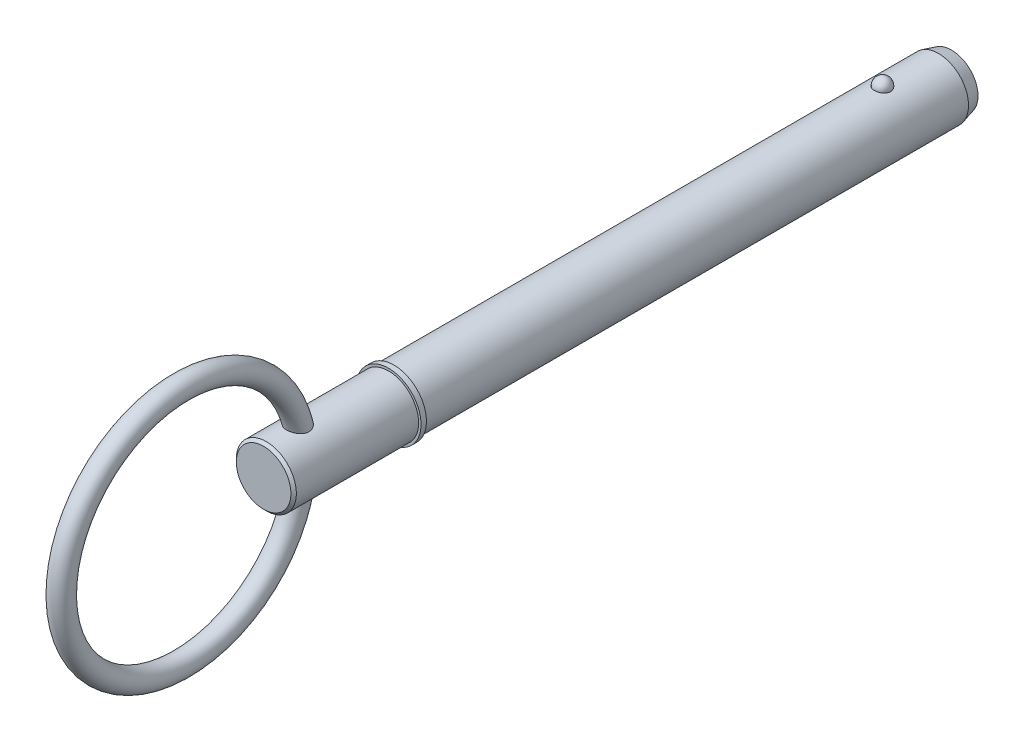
ISO-10303-21;
HEADER;
FILE_DESCRIPTION(('STEP AP214'),'2;1');
FILE_NAME('part.step','',(''),(''),'','','');
FILE_SCHEMA(('AUTOMOTIVE_DESIGN { 1 0 10303 214 1 1 1 1 }'));
ENDSEC;
DATA;
#1=APPLICATION_CONTEXT('core data for automotive mechanical design processes');
#2=APPLICATION_PROTOCOL_DEFINITION('international standard','automotive_design',2000,#1);
#3=PRODUCT_CONTEXT('',#1,'mechanical');
#4=PRODUCT('Part','Part','',(#3));
#5=PRODUCT_RELATED_PRODUCT_CATEGORY('part','',(#4));
#6=PRODUCT_DEFINITION_FORMATION('','',#4);
#7=PRODUCT_DEFINITION_CONTEXT('part definition',#1,'design');
#8=PRODUCT_DEFINITION('design','',#6,#7);
#9=PRODUCT_DEFINITION_SHAPE('','',#8);
#10=(LENGTH_UNIT() NAMED_UNIT(*) SI_UNIT(.MILLI.,.METRE.));
#11=(NAMED_UNIT(*) PLANE_ANGLE_UNIT() SI_UNIT($,.RADIAN.));
#12=(NAMED_UNIT(*) SI_UNIT($,.STERADIAN.) SOLID_ANGLE_UNIT());
#13=UNCERTAINTY_MEASURE_WITH_UNIT(LENGTH_MEASURE(1.E-05),#10,'distance_accuracy_value','');
#14=(GEOMETRIC_REPRESENTATION_CONTEXT(3) GLOBAL_UNCERTAINTY_ASSIGNED_CONTEXT((#13)) GLOBAL_UNIT_ASSIGNED_CONTEXT((#10,
#11,#12)) REPRESENTATION_CONTEXT('',''));
#15=CARTESIAN_POINT('',(0.,0.,0.));
#16=DIRECTION('',(0.,0.,1.));
#17=DIRECTION('',(1.,0.,0.));
#18=AXIS2_PLACEMENT_3D('',#15,#16,#17);
#19=CARTESIAN_POINT('',(0.,0.,88.9));
#20=DIRECTION('',(0.,0.,-1.));
#21=DIRECTION('',(-1.,0.,0.));
#22=AXIS2_PLACEMENT_3D('',#19,#20,#21);
#23=CYLINDRICAL_SURFACE('',#22,5.555);
#24=CARTESIAN_POINT('',(1.47653932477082,5.35517101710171,-1.49));
#25=CARTESIAN_POINT('',(1.4765376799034,5.35517235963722,-1.40667872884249));
#26=CARTESIAN_POINT('',(1.4697233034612,5.35706459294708,-1.32333626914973));
#27=CARTESIAN_POINT('',(1.4426291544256,5.36442332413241,-1.15900769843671));
#28=CARTESIAN_POINT('',(1.42234344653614,5.36989139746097,-1.07802264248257));
#29=CARTESIAN_POINT('',(1.36882802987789,5.38378061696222,-0.920757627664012));
#30=CARTESIAN_POINT('',(1.33560404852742,5.39220045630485,-0.844475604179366));
#31=CARTESIAN_POINT('',(1.25704906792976,5.41105136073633,-0.698703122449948));
#32=CARTESIAN_POINT('',(1.21171855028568,5.42148234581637,-0.629212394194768));
#33=CARTESIAN_POINT('',(1.10986325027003,5.44324765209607,-0.498626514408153));
#34=CARTESIAN_POINT('',(1.05328868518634,5.45458585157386,-0.437570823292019));
#35=CARTESIAN_POINT('',(0.930545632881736,5.4768596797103,-0.325918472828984));
#36=CARTESIAN_POINT('',(0.864377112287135,5.48779530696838,-0.275321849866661));
#37=CARTESIAN_POINT('',(0.724412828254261,5.50801510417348,-0.186125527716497));
#38=CARTESIAN_POINT('',(0.650637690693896,5.51730356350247,-0.147494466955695));
#39=CARTESIAN_POINT('',(0.497383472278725,5.53322345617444,-0.0831582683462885));
#40=CARTESIAN_POINT('',(0.417904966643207,5.53985515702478,-0.0574518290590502));
#41=CARTESIAN_POINT('',(0.256903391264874,5.54963245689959,-0.0200294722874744));
#42=CARTESIAN_POINT('',(0.17543580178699,5.55283384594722,-0.00808940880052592));
#43=CARTESIAN_POINT('',(0.011588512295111,5.55559187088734,0.00221439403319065));
#44=CARTESIAN_POINT('',(-0.0707911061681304,5.55514883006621,0.000579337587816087));
#45=CARTESIAN_POINT('',(-0.232980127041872,5.55069756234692,-0.0161051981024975));
#46=CARTESIAN_POINT('',(-0.312809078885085,5.54673626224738,-0.0309781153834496));
#47=CARTESIAN_POINT('',(-0.468771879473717,5.5357377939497,-0.0734743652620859));
#48=CARTESIAN_POINT('',(-0.544905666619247,5.52870057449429,-0.101097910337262));
#49=CARTESIAN_POINT('',(-0.691800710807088,5.51225307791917,-0.168516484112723));
#50=CARTESIAN_POINT('',(-0.762530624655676,5.50283015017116,-0.2083766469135));
#51=CARTESIAN_POINT('',(-0.896294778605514,5.48263289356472,-0.299136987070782));
#52=CARTESIAN_POINT('',(-0.959328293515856,5.47185843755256,-0.350038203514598));
#53=CARTESIAN_POINT('',(-1.07712789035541,5.44990641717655,-0.462517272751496));
#54=CARTESIAN_POINT('',(-1.13172901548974,5.43872509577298,-0.524267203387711));
#55=CARTESIAN_POINT('',(-1.2299173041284,5.41736658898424,-0.656133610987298));
#56=CARTESIAN_POINT('',(-1.2735037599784,5.40718946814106,-0.726250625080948));
#57=CARTESIAN_POINT('',(-1.34896420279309,5.38886361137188,-0.873713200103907));
#58=CARTESIAN_POINT('',(-1.38071142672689,5.38073711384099,-0.951126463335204));
#59=CARTESIAN_POINT('',(-1.4310375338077,5.36757288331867,-1.11037033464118));
#60=CARTESIAN_POINT('',(-1.44961676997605,5.3625350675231,-1.19220082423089));
#61=CARTESIAN_POINT('',(-1.47308754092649,5.35613553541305,-1.35761209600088));
#62=CARTESIAN_POINT('',(-1.47803294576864,5.35475935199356,-1.44118467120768));
#63=CARTESIAN_POINT('',(-1.47426441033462,5.35579807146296,-1.6079958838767));
#64=CARTESIAN_POINT('',(-1.46555080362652,5.35821288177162,-1.69123452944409));
#65=CARTESIAN_POINT('',(-1.43475662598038,5.36653964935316,-1.8546288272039));
#66=CARTESIAN_POINT('',(-1.41273621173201,5.37243586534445,-1.93479663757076));
#67=CARTESIAN_POINT('',(-1.35593151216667,5.38705199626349,-2.09020110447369));
#68=CARTESIAN_POINT('',(-1.32114675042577,5.39577201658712,-2.16543757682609));
#69=CARTESIAN_POINT('',(-1.23947506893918,5.41511674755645,-2.30926926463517));
#70=CARTESIAN_POINT('',(-1.1925277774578,5.42575087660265,-2.37782893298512));
#71=CARTESIAN_POINT('',(-1.08780725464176,5.44771095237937,-2.50598876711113));
#72=CARTESIAN_POINT('',(-1.03003365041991,5.4590369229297,-2.56558862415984));
#73=CARTESIAN_POINT('',(-0.90495349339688,5.48116073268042,-2.67436535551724));
#74=CARTESIAN_POINT('',(-0.837616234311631,5.49195671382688,-2.7235073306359));
#75=CARTESIAN_POINT('',(-0.69537970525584,5.51177099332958,-2.8097317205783));
#76=CARTESIAN_POINT('',(-0.620480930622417,5.52078940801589,-2.84681492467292));
#77=CARTESIAN_POINT('',(-0.466144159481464,5.53594369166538,-2.90749751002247));
#78=CARTESIAN_POINT('',(-0.386768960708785,5.54211181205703,-2.93124844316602));
#79=CARTESIAN_POINT('',(-0.224991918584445,5.5510324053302,-2.96523308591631));
#80=CARTESIAN_POINT('',(-0.142590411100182,5.55378525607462,-2.97546829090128));
#81=CARTESIAN_POINT('',(0.0213711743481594,5.55555351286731,-2.98206550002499));
#82=CARTESIAN_POINT('',(0.102921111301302,5.55463281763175,-2.97866468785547));
#83=CARTESIAN_POINT('',(0.2642564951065,5.54929804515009,-2.95862186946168));
#84=CARTESIAN_POINT('',(0.344041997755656,5.54488407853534,-2.94198028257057));
#85=CARTESIAN_POINT('',(0.499344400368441,5.53305794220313,-2.89600357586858));
#86=CARTESIAN_POINT('',(0.574874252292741,5.52565550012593,-2.86670961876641));
#87=CARTESIAN_POINT('',(0.71989857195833,5.50863937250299,-2.79624249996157));
#88=CARTESIAN_POINT('',(0.78939269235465,5.49902555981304,-2.75506865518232));
#89=CARTESIAN_POINT('',(0.921480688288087,5.47845199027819,-2.66127110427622));
#90=CARTESIAN_POINT('',(0.983960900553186,5.46747485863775,-2.60849118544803));
#91=CARTESIAN_POINT('',(1.09925057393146,5.44546837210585,-2.49325304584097));
#92=CARTESIAN_POINT('',(1.15205830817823,5.43443900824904,-2.43079310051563));
#93=CARTESIAN_POINT('',(1.24742943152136,5.41335152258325,-2.29680711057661));
#94=CARTESIAN_POINT('',(1.28981661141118,5.40331162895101,-2.22515272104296));
#95=CARTESIAN_POINT('',(1.36214937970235,5.38553336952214,-2.07558035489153));
#96=CARTESIAN_POINT('',(1.39210034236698,5.37779400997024,-1.99766510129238));
#97=CARTESIAN_POINT('',(1.43569518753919,5.36630594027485,-1.84848338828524));
#98=CARTESIAN_POINT('',(1.45098536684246,5.36216169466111,-1.77772322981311));
#99=CARTESIAN_POINT('',(1.47140805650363,5.35659367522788,-1.63464735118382));
#100=CARTESIAN_POINT('',(1.47654075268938,5.35516985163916,-1.5623316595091));
#101=CARTESIAN_POINT('',(1.47653932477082,5.35517101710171,-1.49));
#102=B_SPLINE_CURVE_WITH_KNOTS('',3,(#24,#25,#26,#27,#28,#29,#30,#31,#32,#33,#34,#35,#36,#37,
#38,#39,#40,#41,#42,#43,#44,#45,#46,#47,#48,#49,#50,#51,#52,#53,#54,#55,#56,#57,#58,#59,#60,#61,
#62,#63,#64,#65,#66,#67,#68,#69,#70,#71,#72,#73,#74,#75,#76,#77,#78,#79,#80,#81,#82,#83,#84,#85,
#86,#87,#88,#89,#90,#91,#92,#93,#94,#95,#96,#97,#98,#99,#100,#101),.UNSPECIFIED.,.T.,.F.,(4,2,2,
2,2,2,2,2,2,2,2,2,2,2,2,2,2,2,2,2,2,2,2,2,2,2,2,2,2,2,2,2,2,2,2,2,2,2,4),(0.,0.249703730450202,
0.4995175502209,0.749220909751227,0.998914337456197,1.24973894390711,1.50056442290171,
1.75072681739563,2.00086401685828,2.24686822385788,2.49285060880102,2.73560052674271,
2.97835449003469,3.22242369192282,3.46651587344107,3.71490232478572,3.96330473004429,
4.21429522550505,4.46527899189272,4.71526963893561,4.96525418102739,5.21411697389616,
5.46298905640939,5.71312097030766,5.96326150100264,6.21422412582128,6.46517032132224,
6.71320296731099,6.96120816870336,7.20491846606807,7.44862104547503,7.69153667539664,
7.93446627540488,8.18089104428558,8.42735976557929,8.67774679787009,8.92802551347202,
9.14479867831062,9.36156787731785),.UNSPECIFIED.);
#103=CARTESIAN_POINT('',(1.47653932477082,5.35517101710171,-1.49));
#104=VERTEX_POINT('',#103);
#105=EDGE_CURVE('E102',#104,#104,#102,.T.);
#106=ORIENTED_EDGE('',*,*,#105,.T.);
#107=EDGE_LOOP('',(#106));
#108=FACE_BOUND('',#107,.T.);
#109=CARTESIAN_POINT('',(0.,0.,-11.87));
#110=DIRECTION('',(0.,0.,-1.));
#111=DIRECTION('',(-1.,0.,0.));
#112=AXIS2_PLACEMENT_3D('',#109,#110,#111);
#113=CIRCLE('',#112,5.555);
#114=CARTESIAN_POINT('',(-5.555,0.,-11.87));
#115=VERTEX_POINT('',#114);
#116=EDGE_CURVE('E110',#115,#115,#113,.F.);
#117=ORIENTED_EDGE('',*,*,#116,.T.);
#118=EDGE_LOOP('',(#117));
#119=FACE_BOUND('',#118,.T.);
#120=CARTESIAN_POINT('',(0.,0.,88.9));
#121=DIRECTION('',(0.,0.,1.));
#122=DIRECTION('',(1.,0.,0.));
#123=AXIS2_PLACEMENT_3D('',#120,#121,#122);
#124=CIRCLE('',#123,5.555);
#125=CARTESIAN_POINT('',(5.555,0.,88.9));
#126=VERTEX_POINT('',#125);
#127=EDGE_CURVE('E108',#126,#126,#124,.T.);
#128=ORIENTED_EDGE('',*,*,#127,.F.);
#129=EDGE_LOOP('',(#128));
#130=FACE_BOUND('',#129,.T.);
#131=ADVANCED_FACE('F39',(#108,#119,#130),#23,.T.);
#132=CARTESIAN_POINT('',(0.,0.,-14.27));
#133=DIRECTION('',(0.,0.,-1.));
#134=DIRECTION('',(-1.,0.,0.));
#135=AXIS2_PLACEMENT_3D('',#132,#133,#134);
#136=PLANE('',#135);
#137=CARTESIAN_POINT('',(0.,0.,-14.27));
#138=DIRECTION('',(0.,0.,-1.));
#139=DIRECTION('',(-1.,0.,0.));
#140=AXIS2_PLACEMENT_3D('',#137,#138,#139);
#141=CIRCLE('',#140,4.91192193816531);
#142=CARTESIAN_POINT('',(-4.91192193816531,0.,-14.27));
#143=VERTEX_POINT('',#142);
#144=EDGE_CURVE('E142',#143,#143,#141,.T.);
#145=ORIENTED_EDGE('',*,*,#144,.T.);
#146=EDGE_LOOP('',(#145));
#147=FACE_BOUND('',#146,.T.);
#148=ADVANCED_FACE('F88',(#147),#136,.T.);
#149=CARTESIAN_POINT('',(0.,0.,-14.27));
#150=DIRECTION('',(0.,0.,1.));
#151=DIRECTION('',(1.,0.,0.));
#152=AXIS2_PLACEMENT_3D('',#149,#150,#151);
#153=CONICAL_SURFACE('',#152,4.91192193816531,0.261799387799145);
#154=ORIENTED_EDGE('',*,*,#116,.F.);
#155=EDGE_LOOP('',(#154));
#156=FACE_BOUND('',#155,.T.);
#157=ORIENTED_EDGE('',*,*,#144,.F.);
#158=EDGE_LOOP('',(#157));
#159=FACE_BOUND('',#158,.T.);
#160=ADVANCED_FACE('F94',(#156,#159),#153,.T.);
#161=CARTESIAN_POINT('',(0.,5.555,-1.49));
#162=DIRECTION('',(0.,1.,0.));
#163=DIRECTION('',(0.,0.,-1.));
#164=AXIS2_PLACEMENT_3D('',#161,#162,#163);
#165=SPHERICAL_SURFACE('',#164,1.49);
#166=ORIENTED_EDGE('',*,*,#105,.F.);
#167=EDGE_LOOP('',(#166));
#168=FACE_BOUND('',#167,.T.);
#169=ADVANCED_FACE('F113',(#168),#165,.T.);
#170=CARTESIAN_POINT('',(0.,0.,88.9));
#171=DIRECTION('',(0.,0.,-1.));
#172=DIRECTION('',(-1.,0.,0.));
#173=AXIS2_PLACEMENT_3D('',#170,#171,#172);
#174=PLANE('',#173);
#175=ORIENTED_EDGE('',*,*,#127,.T.);
#176=EDGE_LOOP('',(#175));
#177=FACE_BOUND('',#176,.T.);
#178=CARTESIAN_POINT('',(0.,0.,88.9));
#179=DIRECTION('',(0.,0.,-1.));
#180=DIRECTION('',(-1.,0.,0.));
#181=AXIS2_PLACEMENT_3D('',#178,#179,#180);
#182=CIRCLE('',#181,6.);
#183=CARTESIAN_POINT('',(-6.,0.,88.9));
#184=VERTEX_POINT('',#183);
#185=EDGE_CURVE('E109',#184,#184,#182,.T.);
#186=ORIENTED_EDGE('',*,*,#185,.T.);
#187=EDGE_LOOP('',(#186));
#188=FACE_BOUND('',#187,.T.);
#189=ADVANCED_FACE('F117',(#177,#188),#174,.T.);
#190=CARTESIAN_POINT('',(0.,0.,33.7287874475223));
#191=DIRECTION('',(0.,0.,-1.));
#192=DIRECTION('',(-1.,0.,0.));
#193=AXIS2_PLACEMENT_3D('',#190,#191,#192);
#194=CYLINDRICAL_SURFACE('',#193,6.);
#195=CARTESIAN_POINT('',(0.,0.,89.9));
#196=DIRECTION('',(0.,0.,-1.));
#197=DIRECTION('',(-1.,0.,0.));
#198=AXIS2_PLACEMENT_3D('',#195,#196,#197);
#199=CIRCLE('',#198,6.);
#200=CARTESIAN_POINT('',(-6.,0.,89.9));
#201=VERTEX_POINT('',#200);
#202=EDGE_CURVE('E134',#201,#201,#199,.T.);
#203=ORIENTED_EDGE('',*,*,#202,.T.);
#204=EDGE_LOOP('',(#203));
#205=FACE_BOUND('',#204,.T.);
#206=ORIENTED_EDGE('',*,*,#185,.F.);
#207=EDGE_LOOP('',(#206));
#208=FACE_BOUND('',#207,.T.);
#209=ADVANCED_FACE('F121',(#205,#208),#194,.T.);
#210=CARTESIAN_POINT('',(0.,6.,89.9));
#211=DIRECTION('',(0.,0.,1.));
#212=DIRECTION('',(1.,0.,0.));
#213=AXIS2_PLACEMENT_3D('',#210,#211,#212);
#214=PLANE('',#213);
#215=CARTESIAN_POINT('',(0.,0.,89.9));
#216=DIRECTION('',(0.,0.,1.));
#217=DIRECTION('',(1.,0.,0.));
#218=AXIS2_PLACEMENT_3D('',#215,#216,#217);
#219=CIRCLE('',#218,5.555);
#220=CARTESIAN_POINT('',(5.555,0.,89.9));
#221=VERTEX_POINT('',#220);
#222=EDGE_CURVE('E112',#221,#221,#219,.T.);
#223=ORIENTED_EDGE('',*,*,#222,.F.);
#224=EDGE_LOOP('',(#223));
#225=FACE_BOUND('',#224,.T.);
#226=ORIENTED_EDGE('',*,*,#202,.F.);
#227=EDGE_LOOP('',(#226));
#228=FACE_BOUND('',#227,.T.);
#229=ADVANCED_FACE('F85',(#225,#228),#214,.T.);
#230=CARTESIAN_POINT('',(0.,0.,113.03));
#231=DIRECTION('',(0.,0.,-1.));
#232=DIRECTION('',(-1.,0.,0.));
#233=AXIS2_PLACEMENT_3D('',#230,#231,#232);
#234=CYLINDRICAL_SURFACE('',#233,5.555);
#235=CARTESIAN_POINT('',(-0.961380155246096,-5.47117658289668,104.908733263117));
#236=CARTESIAN_POINT('',(-0.863231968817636,-5.48842171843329,104.857515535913));
#237=CARTESIAN_POINT('',(-0.7605484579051,-5.50372118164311,104.814318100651));
#238=CARTESIAN_POINT('',(-0.548956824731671,-5.52883500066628,104.744912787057));
#239=CARTESIAN_POINT('',(-0.440048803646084,-5.53864944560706,104.718704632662));
#240=CARTESIAN_POINT('',(-0.219033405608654,-5.55178384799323,104.683864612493));
#241=CARTESIAN_POINT('',(-0.106925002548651,-5.55510169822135,104.675238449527));
#242=CARTESIAN_POINT('',(0.11723899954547,-5.55489351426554,104.675783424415));
#243=CARTESIAN_POINT('',(0.229294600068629,-5.55136768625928,104.684954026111));
#244=CARTESIAN_POINT('',(0.449588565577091,-5.5378711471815,104.720784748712));
#245=CARTESIAN_POINT('',(0.557843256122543,-5.52793284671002,104.747356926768));
#246=CARTESIAN_POINT('',(0.768116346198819,-5.50265785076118,104.817309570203));
#247=CARTESIAN_POINT('',(0.87013418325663,-5.48732066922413,104.860691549));
#248=CARTESIAN_POINT('',(1.06580880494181,-5.45270790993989,104.963685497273));
#249=CARTESIAN_POINT('',(1.1594033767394,-5.43340601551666,105.023406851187));
#250=CARTESIAN_POINT('',(1.33484934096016,-5.39298781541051,105.157672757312));
#251=CARTESIAN_POINT('',(1.41670019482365,-5.37187142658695,105.232217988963));
#252=CARTESIAN_POINT('',(1.56628651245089,-5.33017932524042,105.394433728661));
#253=CARTESIAN_POINT('',(1.63402728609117,-5.30960341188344,105.482099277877));
#254=CARTESIAN_POINT('',(1.7533832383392,-5.27139606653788,105.66835593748));
#255=CARTESIAN_POINT('',(1.80500413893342,-5.25376359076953,105.766943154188));
#256=CARTESIAN_POINT('',(1.88923054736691,-5.22405733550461,105.968866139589));
#257=CARTESIAN_POINT('',(1.92240068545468,-5.21182119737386,106.071942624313));
#258=CARTESIAN_POINT('',(1.97156802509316,-5.19342304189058,106.282612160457));
#259=CARTESIAN_POINT('',(1.98756752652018,-5.18726021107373,106.390204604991));
#260=CARTESIAN_POINT('',(2.00238957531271,-5.1815556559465,106.604813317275));
#261=CARTESIAN_POINT('',(2.0015062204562,-5.18190056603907,106.711807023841));
#262=CARTESIAN_POINT('',(1.98404322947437,-5.18861029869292,106.924294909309));
#263=CARTESIAN_POINT('',(1.96745884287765,-5.19497694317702,107.02978862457));
#264=CARTESIAN_POINT('',(1.91810947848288,-5.21340722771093,107.243734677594));
#265=CARTESIAN_POINT('',(1.88435438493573,-5.22581720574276,107.351927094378));
#266=CARTESIAN_POINT('',(1.80161540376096,-5.25491400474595,107.561718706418));
#267=CARTESIAN_POINT('',(1.75262312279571,-5.27160318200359,107.663314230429));
#268=CARTESIAN_POINT('',(1.63431251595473,-5.30955034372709,107.868856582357));
#269=CARTESIAN_POINT('',(1.56333412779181,-5.33111051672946,107.971796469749));
#270=CARTESIAN_POINT('',(1.40529607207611,-5.37493145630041,108.16447165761));
#271=CARTESIAN_POINT('',(1.31822569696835,-5.39719268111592,108.254198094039));
#272=CARTESIAN_POINT('',(1.12728892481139,-5.44031451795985,108.419004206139));
#273=CARTESIAN_POINT('',(1.02309899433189,-5.46113424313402,108.493723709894));
#274=CARTESIAN_POINT('',(0.801576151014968,-5.49800171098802,108.621805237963));
#275=CARTESIAN_POINT('',(0.684264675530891,-5.51405708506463,108.675201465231));
#276=CARTESIAN_POINT('',(0.456877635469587,-5.53719478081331,108.750980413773));
#277=CARTESIAN_POINT('',(0.347974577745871,-5.54519800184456,108.776584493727));
#278=CARTESIAN_POINT('',(0.127042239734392,-5.55464249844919,108.806731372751));
#279=CARTESIAN_POINT('',(0.0150164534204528,-5.55609083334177,108.811296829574));
#280=CARTESIAN_POINT('',(-0.191993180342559,-5.55250986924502,108.799911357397));
#281=CARTESIAN_POINT('',(-0.287160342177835,-5.54836194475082,108.786752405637));
#282=CARTESIAN_POINT('',(-0.473863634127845,-5.53554271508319,108.745489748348));
#283=CARTESIAN_POINT('',(-0.565399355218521,-5.52687090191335,108.717384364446));
#284=CARTESIAN_POINT('',(-0.743786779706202,-5.50572322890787,108.647293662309));
#285=CARTESIAN_POINT('',(-0.830566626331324,-5.49320168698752,108.605141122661));
#286=CARTESIAN_POINT('',(-0.996720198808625,-5.46549909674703,108.508875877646));
#287=CARTESIAN_POINT('',(-1.07609119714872,-5.45031707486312,108.454758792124));
#288=CARTESIAN_POINT('',(-1.23672272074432,-5.41628785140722,108.328211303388));
#289=CARTESIAN_POINT('',(-1.31676039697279,-5.39722327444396,108.25428911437));
#290=CARTESIAN_POINT('',(-1.46504263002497,-5.3588760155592,108.095462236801));
#291=CARTESIAN_POINT('',(-1.53327828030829,-5.33959318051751,108.010549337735));
#292=CARTESIAN_POINT('',(-1.66602271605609,-5.29979878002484,107.818697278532));
#293=CARTESIAN_POINT('',(-1.72857256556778,-5.27951148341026,107.710347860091));
#294=CARTESIAN_POINT('',(-1.83559571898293,-5.24326402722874,107.484325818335));
#295=CARTESIAN_POINT('',(-1.88006296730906,-5.22730531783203,107.366650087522));
#296=CARTESIAN_POINT('',(-1.94988009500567,-5.20167534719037,107.122087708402));
#297=CARTESIAN_POINT('',(-1.97477410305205,-5.19215470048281,106.99505279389));
#298=CARTESIAN_POINT('',(-2.00168294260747,-5.18184594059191,106.738249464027));
#299=CARTESIAN_POINT('',(-2.0037221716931,-5.18104851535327,106.60848411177));
#300=CARTESIAN_POINT('',(-1.98467753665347,-5.18836681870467,106.364652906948));
#301=CARTESIAN_POINT('',(-1.96600067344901,-5.19555485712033,106.250370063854));
#302=CARTESIAN_POINT('',(-1.90923541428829,-5.21668050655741,106.027389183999));
#303=CARTESIAN_POINT('',(-1.87115335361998,-5.23061591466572,105.918689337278));
#304=CARTESIAN_POINT('',(-1.78015350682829,-5.26224244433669,105.718371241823));
#305=CARTESIAN_POINT('',(-1.72857344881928,-5.27957041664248,105.62608293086));
#306=CARTESIAN_POINT('',(-1.61106729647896,-5.31660340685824,105.451684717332));
#307=CARTESIAN_POINT('',(-1.54514024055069,-5.33630858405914,105.369575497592));
#308=CARTESIAN_POINT('',(-1.39929408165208,-5.37641320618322,105.215887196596));
#309=CARTESIAN_POINT('',(-1.31912544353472,-5.39681868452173,105.144546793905));
#310=CARTESIAN_POINT('',(-1.14786008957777,-5.43582099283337,105.015855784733));
#311=CARTESIAN_POINT('',(-1.05676174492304,-5.4544175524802,104.958507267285));
#312=CARTESIAN_POINT('',(-0.961380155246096,-5.47117658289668,104.908733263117));
#313=B_SPLINE_CURVE_WITH_KNOTS('',3,(#235,#236,#237,#238,#239,#240,#241,#242,#243,#244,#245,
#246,#247,#248,#249,#250,#251,#252,#253,#254,#255,#256,#257,#258,#259,#260,#261,#262,#263,#264,
#265,#266,#267,#268,#269,#270,#271,#272,#273,#274,#275,#276,#277,#278,#279,#280,#281,#282,#283,
#284,#285,#286,#287,#288,#289,#290,#291,#292,#293,#294,#295,#296,#297,#298,#299,#300,#301,#302,
#303,#304,#305,#306,#307,#308,#309,#310,#311,#312),.UNSPECIFIED.,.T.,.F.,(4,2,2,2,2,2,2,2,2,2,2,
2,2,2,2,2,2,2,2,2,2,2,2,2,2,2,2,2,2,2,2,2,2,2,2,2,2,2,4),(0.,0.335747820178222,0.67149018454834,
1.0073414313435,1.3431825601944,1.6773394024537,2.01152633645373,2.3480076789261,
2.68450444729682,3.02087435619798,3.35712472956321,3.68242216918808,4.0076760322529,
4.32726924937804,4.6469591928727,4.98762165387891,5.32847210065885,5.7074287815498,
6.08663853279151,6.47407889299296,6.86089527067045,7.19531213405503,7.52936875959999,
7.81649827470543,8.10366003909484,8.39437023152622,8.68518702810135,9.01572837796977,
9.34651809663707,9.72504519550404,10.1036989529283,10.4909301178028,10.8777478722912,
11.2239231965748,11.5699855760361,11.8899109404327,12.2098577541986,12.5360928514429,
12.8623766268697),.UNSPECIFIED.);
#314=CARTESIAN_POINT('',(-0.961380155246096,-5.47117658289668,104.908733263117));
#315=VERTEX_POINT('',#314);
#316=EDGE_CURVE('E10',#315,#315,#313,.T.);
#317=ORIENTED_EDGE('',*,*,#316,.F.);
#318=EDGE_LOOP('',(#317));
#319=FACE_BOUND('',#318,.T.);
#320=CARTESIAN_POINT('',(-0.961380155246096,5.47117658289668,104.908733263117));
#321=CARTESIAN_POINT('',(-1.05891474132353,5.45403910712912,104.959631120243));
#322=CARTESIAN_POINT('',(-1.15197270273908,5.43497920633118,105.018451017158));
#323=CARTESIAN_POINT('',(-1.32661268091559,5.39501222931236,105.15070162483));
#324=CARTESIAN_POINT('',(-1.40819495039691,5.37410519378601,105.224132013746));
#325=CARTESIAN_POINT('',(-1.55769110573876,5.33269731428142,105.384098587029));
#326=CARTESIAN_POINT('',(-1.62558729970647,5.3121970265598,105.470651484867));
#327=CARTESIAN_POINT('',(-1.74556031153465,5.27399510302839,105.654646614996));
#328=CARTESIAN_POINT('',(-1.7976419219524,5.25629262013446,105.752085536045));
#329=CARTESIAN_POINT('',(-1.88339939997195,5.22617061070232,105.952565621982));
#330=CARTESIAN_POINT('',(-1.91750373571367,5.21362983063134,106.055405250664));
#331=CARTESIAN_POINT('',(-1.96852412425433,5.194582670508,106.265778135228));
#332=CARTESIAN_POINT('',(-1.98544249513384,5.18807547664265,106.373310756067));
#333=CARTESIAN_POINT('',(-2.00201964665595,5.18170011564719,106.587819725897));
#334=CARTESIAN_POINT('',(-2.00199605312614,5.18170977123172,106.694768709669));
#335=CARTESIAN_POINT('',(-1.98621575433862,5.18777751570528,106.907306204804));
#336=CARTESIAN_POINT('',(-1.97045441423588,5.19383738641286,107.012894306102));
#337=CARTESIAN_POINT('',(-1.92280904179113,5.21167084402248,107.226914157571));
#338=CARTESIAN_POINT('',(-1.88996782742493,5.22378174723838,107.335103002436));
#339=CARTESIAN_POINT('',(-1.8090690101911,5.252344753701,107.545029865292));
#340=CARTESIAN_POINT('',(-1.76100319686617,5.26879919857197,107.646764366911));
#341=CARTESIAN_POINT('',(-1.64464870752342,5.30634509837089,107.852788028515));
#342=CARTESIAN_POINT('',(-1.57469702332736,5.32774959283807,107.956085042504));
#343=CARTESIAN_POINT('',(-1.41872356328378,5.37138743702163,108.149688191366));
#344=CARTESIAN_POINT('',(-1.3326906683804,5.39362135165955,108.239985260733));
#345=CARTESIAN_POINT('',(-1.14345202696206,5.43692909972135,108.406557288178));
#346=CARTESIAN_POINT('',(-1.03986000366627,5.45795811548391,108.482409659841));
#347=CARTESIAN_POINT('',(-0.819338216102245,5.49537389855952,108.612916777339));
#348=CARTESIAN_POINT('',(-0.70242947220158,5.51176784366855,108.667604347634));
#349=CARTESIAN_POINT('',(-0.475167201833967,5.53565843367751,108.74602203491));
#350=CARTESIAN_POINT('',(-0.365997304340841,5.54404610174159,108.772893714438));
#351=CARTESIAN_POINT('',(-0.144272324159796,5.55422966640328,108.805426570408));
#352=CARTESIAN_POINT('',(-0.031721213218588,5.55603301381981,108.811111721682));
#353=CARTESIAN_POINT('',(0.176166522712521,5.55303883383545,108.801592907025));
#354=CARTESIAN_POINT('',(0.271662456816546,5.54914868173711,108.789260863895));
#355=CARTESIAN_POINT('',(0.459140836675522,5.53678955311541,108.749523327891));
#356=CARTESIAN_POINT('',(0.551122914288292,5.52832009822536,108.722116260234));
#357=CARTESIAN_POINT('',(0.730082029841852,5.50755841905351,108.653437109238));
#358=CARTESIAN_POINT('',(0.817013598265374,5.49523641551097,108.612056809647));
#359=CARTESIAN_POINT('',(0.98356924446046,5.46788364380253,108.517293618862));
#360=CARTESIAN_POINT('',(1.06319070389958,5.45285191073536,108.463906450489));
#361=CARTESIAN_POINT('',(1.22430017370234,5.4191117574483,108.338982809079));
#362=CARTESIAN_POINT('',(1.30459540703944,5.40018081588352,108.265970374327));
#363=CARTESIAN_POINT('',(1.45353150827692,5.3620139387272,108.108943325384));
#364=CARTESIAN_POINT('',(1.52216366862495,5.3427777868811,108.024920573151));
#365=CARTESIAN_POINT('',(1.65601602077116,5.30294271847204,107.834811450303));
#366=CARTESIAN_POINT('',(1.71927851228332,5.28255425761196,107.727294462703));
#367=CARTESIAN_POINT('',(1.82790996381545,5.24595721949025,107.502847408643));
#368=CARTESIAN_POINT('',(1.8732722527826,5.22975020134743,107.385913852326));
#369=CARTESIAN_POINT('',(1.94526503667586,5.20341207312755,107.142194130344));
#370=CARTESIAN_POINT('',(1.97135787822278,5.1934564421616,107.01522738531));
#371=CARTESIAN_POINT('',(2.00068973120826,5.18223330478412,106.758318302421));
#372=CARTESIAN_POINT('',(2.00395290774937,5.18095661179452,106.628379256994));
#373=CARTESIAN_POINT('',(1.98717985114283,5.1874070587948,106.383763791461));
#374=CARTESIAN_POINT('',(1.96951989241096,5.19421607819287,106.268899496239));
#375=CARTESIAN_POINT('',(1.91463360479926,5.2146960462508,106.044589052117));
#376=CARTESIAN_POINT('',(1.87741409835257,5.22836460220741,105.935141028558));
#377=CARTESIAN_POINT('',(1.78800305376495,5.25957304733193,105.733542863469));
#378=CARTESIAN_POINT('',(1.73720600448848,5.27672774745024,105.640709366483));
#379=CARTESIAN_POINT('',(1.62116201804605,5.3135255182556,105.465121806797));
#380=CARTESIAN_POINT('',(1.55591428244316,5.33316872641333,105.382368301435));
#381=CARTESIAN_POINT('',(1.41164041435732,5.37317145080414,105.227648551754));
#382=CARTESIAN_POINT('',(1.33241957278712,5.39353732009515,105.155865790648));
#383=CARTESIAN_POINT('',(1.16300716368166,5.43258596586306,105.026112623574));
#384=CARTESIAN_POINT('',(1.07281393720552,5.45126848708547,104.968144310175));
#385=CARTESIAN_POINT('',(0.880638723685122,5.48564753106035,104.865507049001));
#386=CARTESIAN_POINT('',(0.77836470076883,5.50122427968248,104.821343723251));
#387=CARTESIAN_POINT('',(0.567418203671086,5.52696543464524,104.749973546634));
#388=CARTESIAN_POINT('',(0.458745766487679,5.53712987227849,104.72276659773));
#389=CARTESIAN_POINT('',(0.23779150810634,5.55101406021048,104.685879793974));
#390=CARTESIAN_POINT('',(0.12550171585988,5.55471842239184,104.67624178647));
#391=CARTESIAN_POINT('',(-0.0992056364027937,5.55525045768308,104.674849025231));
#392=CARTESIAN_POINT('',(-0.211623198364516,5.55207802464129,104.683094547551));
#393=CARTESIAN_POINT('',(-0.43421780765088,5.53913427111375,104.717408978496));
#394=CARTESIAN_POINT('',(-0.544370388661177,5.52931142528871,104.743617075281));
#395=CARTESIAN_POINT('',(-0.758352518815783,5.50404767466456,104.813395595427));
#396=CARTESIAN_POINT('',(-0.862181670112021,5.48860641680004,104.856967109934));
#397=CARTESIAN_POINT('',(-0.961380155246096,5.47117658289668,104.908733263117));
#398=B_SPLINE_CURVE_WITH_KNOTS('',3,(#320,#321,#322,#323,#324,#325,#326,#327,#328,#329,#330,
#331,#332,#333,#334,#335,#336,#337,#338,#339,#340,#341,#342,#343,#344,#345,#346,#347,#348,#349,
#350,#351,#352,#353,#354,#355,#356,#357,#358,#359,#360,#361,#362,#363,#364,#365,#366,#367,#368,
#369,#370,#371,#372,#373,#374,#375,#376,#377,#378,#379,#380,#381,#382,#383,#384,#385,#386,#387,
#388,#389,#390,#391,#392,#393,#394,#395,#396,#397),.UNSPECIFIED.,.T.,.F.,(4,2,2,2,2,2,2,2,2,2,2,
2,2,2,2,2,2,2,2,2,2,2,2,2,2,2,2,2,2,2,2,2,2,2,2,2,2,2,4),(0.,0.333636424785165,
0.667265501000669,1.00132312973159,1.33527942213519,1.66086829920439,1.98641325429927,
2.30585509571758,2.62539104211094,2.96514840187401,3.30508930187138,3.68313901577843,
4.06145109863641,4.4495380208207,4.83702062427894,5.17316628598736,5.508931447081,
5.79666415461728,6.08442692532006,6.37447144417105,6.66461944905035,6.99384361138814,
7.32331250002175,7.70083591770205,8.07849989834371,8.46633986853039,8.85376924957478,
9.20110411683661,9.54831791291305,9.86844524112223,10.1885902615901,10.513611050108,
10.8386810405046,11.1745469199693,11.5104108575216,11.8470737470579,12.183741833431,
12.5230486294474,12.8623767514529),.UNSPECIFIED.);
#399=CARTESIAN_POINT('',(-0.961380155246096,5.47117658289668,104.908733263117));
#400=VERTEX_POINT('',#399);
#401=EDGE_CURVE('E51',#400,#400,#398,.T.);
#402=ORIENTED_EDGE('',*,*,#401,.F.);
#403=EDGE_LOOP('',(#402));
#404=FACE_BOUND('',#403,.T.);
#405=CARTESIAN_POINT('',(0.,0.,112.53));
#406=DIRECTION('',(0.,0.,-1.));
#407=DIRECTION('',(-1.,0.,0.));
#408=AXIS2_PLACEMENT_3D('',#405,#406,#407);
#409=CIRCLE('',#408,5.555);
#410=CARTESIAN_POINT('',(-5.555,0.,112.53));
#411=VERTEX_POINT('',#410);
#412=EDGE_CURVE('E64',#411,#411,#409,.T.);
#413=ORIENTED_EDGE('',*,*,#412,.T.);
#414=EDGE_LOOP('',(#413));
#415=FACE_BOUND('',#414,.T.);
#416=ORIENTED_EDGE('',*,*,#222,.T.);
#417=EDGE_LOOP('',(#416));
#418=FACE_BOUND('',#417,.T.);
#419=ADVANCED_FACE('F69',(#319,#404,#415,#418),#234,.T.);
#420=CARTESIAN_POINT('',(0.,0.,113.03));
#421=DIRECTION('',(0.,0.,-1.));
#422=DIRECTION('',(-1.,0.,0.));
#423=AXIS2_PLACEMENT_3D('',#420,#421,#422);
#424=PLANE('',#423);
#425=CARTESIAN_POINT('',(0.,0.,113.03));
#426=DIRECTION('',(0.,0.,-1.));
#427=DIRECTION('',(-1.,0.,0.));
#428=AXIS2_PLACEMENT_3D('',#425,#426,#427);
#429=CIRCLE('',#428,5.05499999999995);
#430=CARTESIAN_POINT('',(-5.05499999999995,0.,113.03));
#431=VERTEX_POINT('',#430);
#432=EDGE_CURVE('E57',#431,#431,#429,.F.);
#433=ORIENTED_EDGE('',*,*,#432,.T.);
#434=EDGE_LOOP('',(#433));
#435=FACE_BOUND('',#434,.T.);
#436=ADVANCED_FACE('F76',(#435),#424,.F.);
#437=CARTESIAN_POINT('',(0.,0.,112.53));
#438=DIRECTION('',(0.,0.,-1.));
#439=DIRECTION('',(-1.,0.,0.));
#440=AXIS2_PLACEMENT_3D('',#437,#438,#439);
#441=CONICAL_SURFACE('',#440,5.555,0.785398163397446);
#442=ORIENTED_EDGE('',*,*,#432,.F.);
#443=EDGE_LOOP('',(#442));
#444=FACE_BOUND('',#443,.T.);
#445=ORIENTED_EDGE('',*,*,#412,.F.);
#446=EDGE_LOOP('',(#445));
#447=FACE_BOUND('',#446,.T.);
#448=ADVANCED_FACE('F41',(#444,#447),#441,.T.);
#449=CARTESIAN_POINT('',(0.,0.,128.255));
#450=DIRECTION('',(1.,0.,0.));
#451=DIRECTION('',(0.,0.,-1.));
#452=AXIS2_PLACEMENT_3D('',#449,#450,#451);
#453=TOROIDAL_SURFACE('',#452,22.225,2.);
#454=ORIENTED_EDGE('',*,*,#316,.T.);
#455=EDGE_LOOP('',(#454));
#456=FACE_BOUND('',#455,.T.);
#457=ORIENTED_EDGE('',*,*,#401,.T.);
#458=EDGE_LOOP('',(#457));
#459=FACE_BOUND('',#458,.T.);
#460=ADVANCED_FACE('F73',(#456,#459),#453,.T.);
#461=CLOSED_SHELL('',(#131,#148,#160,#169,#189,#209,#229,#419,#436,#448,#460));
#462=MANIFOLD_SOLID_BREP('B2',#461);
#463=ADVANCED_BREP_SHAPE_REPRESENTATION('',(#18,#462),#14);
#464=SHAPE_DEFINITION_REPRESENTATION(#9,#463);
ENDSEC;
END-ISO-10303-21;
